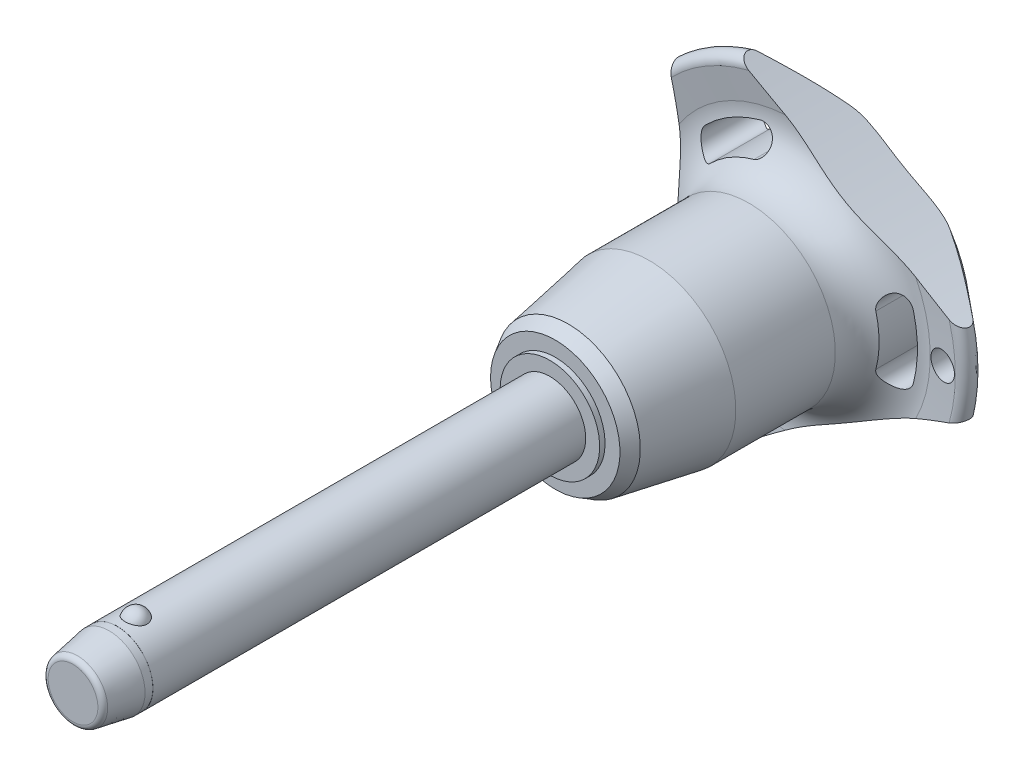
from build123d import *

# Parameters (mm, degrees)
SKETCH1_R           = 4
BOSS_EXTRUDE1_DEPTH = 45
SKETCH2_R           = 3.4
BOSS_EXTRUDE2_DEPTH = 33.3
BOSS_EXTRUDE3_START = 8.2
SKETCH1_2_R         = 4
BOSS_EXTRUDE3_DEPTH = 8.2
CHAMFER1_SIZE       = 4.1
CHAMFER1_SIZE2      = 0.722940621
FILLET1_R           = 0.6
SKETCH6_R           = 102.8
CUT_EXTRUDE1_DEPTH  = 84.064879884
CIRPATTERN1_COUNT   = 3
SKETCH7_R           = 1.5
CUT_EXTRUDE2_DEPTH  = 83.869938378
SKETCH8_R           = 4
SKETCH8_R_2         = 3.99
CUT_EXTRUDE3_DEPTH  = 4.92


with BuildPart() as part:
    # Sketch1 → Boss-Extrude1 (new body)
    with BuildSketch(Plane.XY):
        Circle(SKETCH1_R)
    extrude(amount=-BOSS_EXTRUDE1_DEPTH)

    # Sketch2 → Boss-Extrude2 (add)
    with BuildSketch(Plane(origin=(0, 0, -45), x_dir=(-1, 0, 0), z_dir=(0, 0, -1))):
        Circle(SKETCH2_R)
    extrude(amount=BOSS_EXTRUDE2_DEPTH)

    # Sketch3 → Revolve1 (revolve)
    with BuildSketch(Plane(origin=(0, 0, 0), x_dir=(0, 0, -1), z_dir=(1, 0, 0))):
        with BuildLine():
            Line((-1.2, 4.8), (-1.2, 2.2))
            ThreePointArc((-1.2, 2.2), (0.1, 3.5), (-1.2, 4.8))
        make_face()
        with BuildLine():
            Line((-1.2, -2.2), (-1.2, -4.8))
            ThreePointArc((-1.2, -4.8), (0.1, -3.5), (-1.2, -2.2))
        make_face()
    revolve(axis=Axis((0, -2.2, 1.2), (0, 1, 0)))

    # Sketch1_2 → Boss-Extrude3 (add)
    with BuildSketch(Plane.XY.offset(BOSS_EXTRUDE3_START)):
        Circle(SKETCH1_2_R)
    extrude(amount=-BOSS_EXTRUDE3_DEPTH)

    # Chamfer1
    chamfer1_edges = [part.edges().sort_by_distance(p)[0] for p in [
        (-4, 0, 8.2),
    ]]
    chamfer1_side = [part.faces().sort_by_distance(p)[0] for p in [
        (-4, 0, -18.4),
    ]]
    chamfer(chamfer1_edges, length=CHAMFER1_SIZE, length2=CHAMFER1_SIZE2, reference=chamfer1_side[0])

    # Fillet1
    fillet1_edges = [part.edges().sort_by_distance(p)[0] for p in [
        (-3.277059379, 0, 8.2),
        (3.4, 0, -78.3),
    ]]
    fillet(fillet1_edges, radius=FILLET1_R)

    # Sketch4 → Revolve2 (revolve)
    with BuildSketch(Plane(origin=(0, 0, 0), x_dir=(0, 0, -1), z_dir=(1, 0, 0)), mode=Mode.PRIVATE) as revolve2_sk:
        Polygon((45, 0), (45, 5.554101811), (45.6, 5.554101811), (45.6, 7.220004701), (47.042714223, 8.052956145), (56.1, 9.65), (67.2, 9.65), (67.2, 0), align=None)
    revolve(revolve2_sk.sketch.rotate(Axis((0, 0, -67.2), (0, 0, 1)), 90), axis=Axis((0, 0, -67.2), (0, 0, 1)))

    # Sketch5 → Revolve3 (revolve)
    with BuildSketch(Plane(origin=(0, 0, 0), x_dir=(0, 0, -1), z_dir=(1, 0, 0)), mode=Mode.PRIVATE) as revolve3_sk:
        with BuildLine():
            Line((72.16082631, 15.274661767), (71.757834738, 18.475067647))
            ThreePointArc((71.757834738, 18.475067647), (72.349836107, 19.516443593), (73.516044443, 19.24278761))
            Line((73.516044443, 19.24278761), (77.835691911, 14.094832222))
            ThreePointArc((77.835691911, 14.094832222), (78.3, 12.689260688), (77.67067517, 11.349423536))
            ThreePointArc((77.67067517, 11.349423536), (74.033110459, 6.185112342), (72.75, 0))
            Line((72.75, 0), (67.2, 0))
            Line((67.2, 0), (67.2, 9.65))
            ThreePointArc((67.2, 9.65), (70.949887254, 11.342683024), (72.16082631, 15.274661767))
        make_face()
    revolve(revolve3_sk.sketch.rotate(Axis((0, 0, -72.75), (0, 0, 1)), 90), axis=Axis((0, 0, -72.75), (0, 0, 1)))

    # Sketch6 → Cut-Extrude1 (cut, through all)
    with BuildSketch(Plane.XY):
        with Locations((-115.2, 0)):
            Circle(SKETCH6_R)
        with BuildLine():
            ThreePointArc((13.411913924, -3.529271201), (13.868496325, 0), (13.411913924, 3.529271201))
            ThreePointArc((13.411913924, 3.529271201), (11.694200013, 4.531299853), (10.692171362, 2.813585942))
            ThreePointArc((10.692171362, 2.813585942), (11.056165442, 0), (10.692171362, -2.813585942))
            ThreePointArc((10.692171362, -2.813585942), (11.694200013, -4.531299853), (13.411913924, -3.529271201))
        make_face()
    cut_extrude1 = extrude(amount=-CUT_EXTRUDE1_DEPTH, mode=Mode.SUBTRACT)

    # CirPattern1: Cut-Extrude1 ×3 about axis
    cirpattern1_axis = Axis((0, 0, 0), (0, 0, 1))
    for i in range(1, CIRPATTERN1_COUNT):
        add(cut_extrude1.rotate(cirpattern1_axis, i * 360 / CIRPATTERN1_COUNT), mode=Mode.SUBTRACT)

    # Sketch7 → Cut-Extrude2 (cut, through all)
    with BuildSketch(Plane.XY):
        with Locations(Location((16.868496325, 0, 0), (0, 0, 225.467095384))):
            Circle(SKETCH7_R)
    extrude(amount=-CUT_EXTRUDE2_DEPTH, mode=Mode.SUBTRACT)

    # Sketch8 → Cut-Extrude3 (cut)
    with BuildSketch(Plane.XY.offset(8.2)):
        Circle(SKETCH8_R)
        Circle(SKETCH8_R_2, mode=Mode.SUBTRACT)
    extrude(amount=-CUT_EXTRUDE3_DEPTH, mode=Mode.SUBTRACT)


solid = part.part
